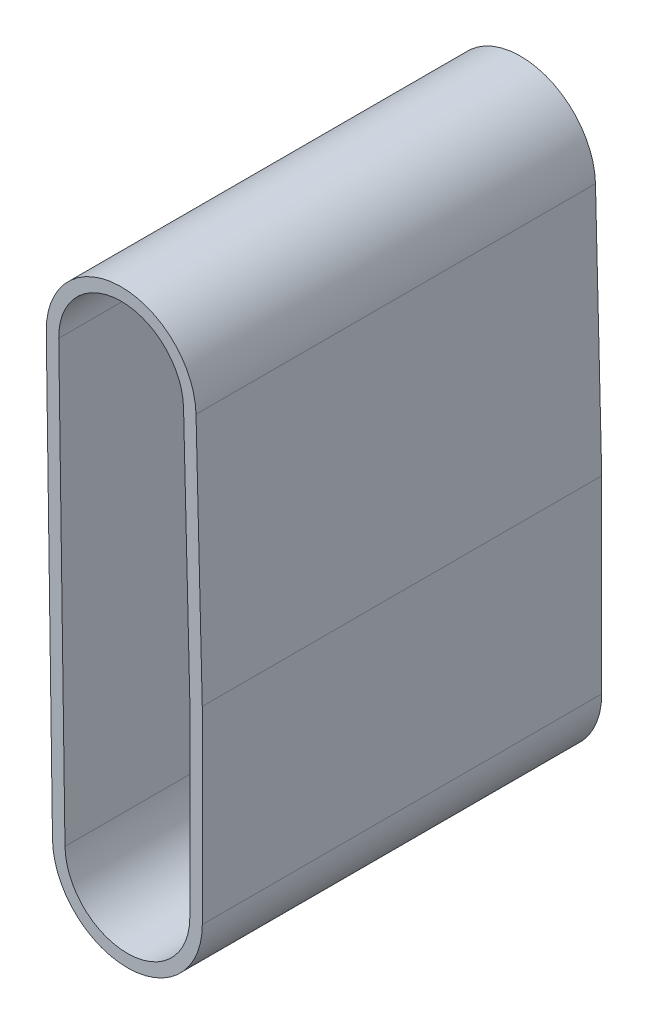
ISO-10303-21;
HEADER;
FILE_DESCRIPTION(('STEP AP214'),'2;1');
FILE_NAME('part.step','',(''),(''),'','','');
FILE_SCHEMA(('AUTOMOTIVE_DESIGN { 1 0 10303 214 1 1 1 1 }'));
ENDSEC;
DATA;
#1=APPLICATION_CONTEXT('core data for automotive mechanical design processes');
#2=APPLICATION_PROTOCOL_DEFINITION('international standard','automotive_design',2000,#1);
#3=PRODUCT_CONTEXT('',#1,'mechanical');
#4=PRODUCT('Part','Part','',(#3));
#5=PRODUCT_RELATED_PRODUCT_CATEGORY('part','',(#4));
#6=PRODUCT_DEFINITION_FORMATION('','',#4);
#7=PRODUCT_DEFINITION_CONTEXT('part definition',#1,'design');
#8=PRODUCT_DEFINITION('design','',#6,#7);
#9=PRODUCT_DEFINITION_SHAPE('','',#8);
#10=(LENGTH_UNIT() NAMED_UNIT(*) SI_UNIT(.MILLI.,.METRE.));
#11=(NAMED_UNIT(*) PLANE_ANGLE_UNIT() SI_UNIT($,.RADIAN.));
#12=(NAMED_UNIT(*) SI_UNIT($,.STERADIAN.) SOLID_ANGLE_UNIT());
#13=UNCERTAINTY_MEASURE_WITH_UNIT(LENGTH_MEASURE(1.E-05),#10,'distance_accuracy_value','');
#14=(GEOMETRIC_REPRESENTATION_CONTEXT(3) GLOBAL_UNCERTAINTY_ASSIGNED_CONTEXT((#13)) GLOBAL_UNIT_ASSIGNED_CONTEXT((#10,
#11,#12)) REPRESENTATION_CONTEXT('',''));
#15=CARTESIAN_POINT('',(0.,0.,0.));
#16=DIRECTION('',(0.,0.,1.));
#17=DIRECTION('',(1.,0.,0.));
#18=AXIS2_PLACEMENT_3D('',#15,#16,#17);
#19=CARTESIAN_POINT('',(-2.5,175.,-80.));
#20=DIRECTION('',(0.,0.,1.));
#21=DIRECTION('',(1.,0.,0.));
#22=AXIS2_PLACEMENT_3D('',#19,#20,#21);
#23=CYLINDRICAL_SURFACE('',#22,30.);
#24=DIRECTION('',(0.,0.,1.));
#25=VECTOR('',#24,1.);
#26=CARTESIAN_POINT('',(-32.4969392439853,174.571472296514,-80.));
#27=LINE('',#26,#25);
#28=CARTESIAN_POINT('',(-32.4969392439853,174.571472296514,-80.));
#29=VERTEX_POINT('',#28);
#30=CARTESIAN_POINT('',(-32.4969392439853,174.571472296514,80.));
#31=VERTEX_POINT('',#30);
#32=EDGE_CURVE('E46',#29,#31,#27,.T.);
#33=ORIENTED_EDGE('',*,*,#32,.T.);
#34=CARTESIAN_POINT('',(-2.5,175.,80.));
#35=DIRECTION('',(0.,0.,1.));
#36=DIRECTION('',(1.,0.,0.));
#37=AXIS2_PLACEMENT_3D('',#34,#35,#36);
#38=CIRCLE('',#37,30.);
#39=CARTESIAN_POINT('',(27.4906293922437,175.749765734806,80.));
#40=VERTEX_POINT('',#39);
#41=EDGE_CURVE('E161',#40,#31,#38,.T.);
#42=ORIENTED_EDGE('',*,*,#41,.F.);
#43=DIRECTION('',(0.,0.,1.));
#44=VECTOR('',#43,1.);
#45=CARTESIAN_POINT('',(27.4906293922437,175.749765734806,-80.));
#46=LINE('',#45,#44);
#47=CARTESIAN_POINT('',(27.4906293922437,175.749765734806,-80.));
#48=VERTEX_POINT('',#47);
#49=EDGE_CURVE('E11',#48,#40,#46,.T.);
#50=ORIENTED_EDGE('',*,*,#49,.F.);
#51=CARTESIAN_POINT('',(-2.5,175.,-80.));
#52=DIRECTION('',(0.,0.,1.));
#53=DIRECTION('',(1.,0.,0.));
#54=AXIS2_PLACEMENT_3D('',#51,#52,#53);
#55=CIRCLE('',#54,30.);
#56=EDGE_CURVE('E197',#48,#29,#55,.T.);
#57=ORIENTED_EDGE('',*,*,#56,.T.);
#58=EDGE_LOOP('',(#33,#42,#50,#57));
#59=FACE_BOUND('',#58,.T.);
#60=ADVANCED_FACE('F43',(#59),#23,.T.);
#61=CARTESIAN_POINT('',(27.4906293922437,175.749765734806,-80.));
#62=DIRECTION('',(0.999687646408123,0.024992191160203,0.));
#63=DIRECTION('',(-0.024992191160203,0.999687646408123,0.));
#64=AXIS2_PLACEMENT_3D('',#61,#62,#63);
#65=PLANE('',#64);
#66=ORIENTED_EDGE('',*,*,#49,.T.);
#67=DIRECTION('',(-0.024992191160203,0.999687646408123,0.));
#68=VECTOR('',#67,1.);
#69=CARTESIAN_POINT('',(27.4906293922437,175.749765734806,80.));
#70=LINE('',#69,#68);
#71=CARTESIAN_POINT('',(29.9921847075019,75.687553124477,80.));
#72=VERTEX_POINT('',#71);
#73=EDGE_CURVE('E177',#72,#40,#70,.T.);
#74=ORIENTED_EDGE('',*,*,#73,.F.);
#75=DIRECTION('',(0.,0.,1.));
#76=VECTOR('',#75,1.);
#77=CARTESIAN_POINT('',(29.9921847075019,75.687553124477,-80.));
#78=LINE('',#77,#76);
#79=CARTESIAN_POINT('',(29.9921847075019,75.687553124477,-80.));
#80=VERTEX_POINT('',#79);
#81=EDGE_CURVE('E52',#80,#72,#78,.T.);
#82=ORIENTED_EDGE('',*,*,#81,.F.);
#83=DIRECTION('',(-0.024992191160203,0.999687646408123,0.));
#84=VECTOR('',#83,1.);
#85=CARTESIAN_POINT('',(27.4906293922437,175.749765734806,-80.));
#86=LINE('',#85,#84);
#87=EDGE_CURVE('E220',#80,#48,#86,.T.);
#88=ORIENTED_EDGE('',*,*,#87,.T.);
#89=EDGE_LOOP('',(#66,#74,#82,#88));
#90=FACE_BOUND('',#89,.T.);
#91=ADVANCED_FACE('F240',(#90),#65,.T.);
#92=CARTESIAN_POINT('',(29.9921847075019,75.687553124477,-80.));
#93=DIRECTION('',(0.999999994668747,0.000103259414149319,0.));
#94=DIRECTION('',(-0.000103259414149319,0.999999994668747,0.));
#95=AXIS2_PLACEMENT_3D('',#92,#93,#94);
#96=PLANE('',#95);
#97=ORIENTED_EDGE('',*,*,#81,.T.);
#98=DIRECTION('',(-0.000103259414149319,0.999999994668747,0.));
#99=VECTOR('',#98,1.);
#100=CARTESIAN_POINT('',(29.9921847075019,75.687553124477,80.));
#101=LINE('',#100,#99);
#102=CARTESIAN_POINT('',(29.9999998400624,0.00309778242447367,80.));
#103=VERTEX_POINT('',#102);
#104=EDGE_CURVE('E173',#103,#72,#101,.T.);
#105=ORIENTED_EDGE('',*,*,#104,.F.);
#106=DIRECTION('',(0.,0.,1.));
#107=VECTOR('',#106,1.);
#108=CARTESIAN_POINT('',(29.9999998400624,0.00309778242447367,-80.));
#109=LINE('',#108,#107);
#110=CARTESIAN_POINT('',(29.9999998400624,0.00309778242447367,-80.));
#111=VERTEX_POINT('',#110);
#112=EDGE_CURVE('E226',#111,#103,#109,.T.);
#113=ORIENTED_EDGE('',*,*,#112,.F.);
#114=DIRECTION('',(-0.000103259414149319,0.999999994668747,0.));
#115=VECTOR('',#114,1.);
#116=CARTESIAN_POINT('',(29.9921847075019,75.687553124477,-80.));
#117=LINE('',#116,#115);
#118=EDGE_CURVE('E216',#111,#80,#117,.T.);
#119=ORIENTED_EDGE('',*,*,#118,.T.);
#120=EDGE_LOOP('',(#97,#105,#113,#119));
#121=FACE_BOUND('',#120,.T.);
#122=ADVANCED_FACE('F249',(#121),#96,.T.);
#123=CARTESIAN_POINT('',(0.,0.,-80.));
#124=DIRECTION('',(0.,0.,1.));
#125=DIRECTION('',(1.,0.,0.));
#126=AXIS2_PLACEMENT_3D('',#123,#124,#125);
#127=CYLINDRICAL_SURFACE('',#126,30.);
#128=ORIENTED_EDGE('',*,*,#112,.T.);
#129=CARTESIAN_POINT('',(0.,0.,80.));
#130=DIRECTION('',(0.,0.,1.));
#131=DIRECTION('',(1.,0.,0.));
#132=AXIS2_PLACEMENT_3D('',#129,#130,#131);
#133=CIRCLE('',#132,30.);
#134=CARTESIAN_POINT('',(-29.9969392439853,-0.428527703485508,80.));
#135=VERTEX_POINT('',#134);
#136=EDGE_CURVE('E169',#135,#103,#133,.T.);
#137=ORIENTED_EDGE('',*,*,#136,.F.);
#138=DIRECTION('',(0.,0.,1.));
#139=VECTOR('',#138,1.);
#140=CARTESIAN_POINT('',(-29.9969392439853,-0.428527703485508,-80.));
#141=LINE('',#140,#139);
#142=CARTESIAN_POINT('',(-29.9969392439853,-0.428527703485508,-80.));
#143=VERTEX_POINT('',#142);
#144=EDGE_CURVE('E228',#143,#135,#141,.T.);
#145=ORIENTED_EDGE('',*,*,#144,.F.);
#146=CARTESIAN_POINT('',(0.,0.,-80.));
#147=DIRECTION('',(0.,0.,1.));
#148=DIRECTION('',(1.,0.,0.));
#149=AXIS2_PLACEMENT_3D('',#146,#147,#148);
#150=CIRCLE('',#149,30.);
#151=EDGE_CURVE('E212',#143,#111,#150,.T.);
#152=ORIENTED_EDGE('',*,*,#151,.T.);
#153=EDGE_LOOP('',(#128,#137,#145,#152));
#154=FACE_BOUND('',#153,.T.);
#155=ADVANCED_FACE('F247',(#154),#127,.T.);
#156=CARTESIAN_POINT('',(-32.4969392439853,174.571472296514,-80.));
#157=DIRECTION('',(-0.99989797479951,-0.0142842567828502,0.));
#158=DIRECTION('',(0.0142842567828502,-0.99989797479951,0.));
#159=AXIS2_PLACEMENT_3D('',#156,#157,#158);
#160=PLANE('',#159);
#161=ORIENTED_EDGE('',*,*,#144,.T.);
#162=DIRECTION('',(0.0142842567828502,-0.99989797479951,0.));
#163=VECTOR('',#162,1.);
#164=CARTESIAN_POINT('',(-32.4969392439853,174.571472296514,80.));
#165=LINE('',#164,#163);
#166=EDGE_CURVE('E165',#31,#135,#165,.T.);
#167=ORIENTED_EDGE('',*,*,#166,.F.);
#168=ORIENTED_EDGE('',*,*,#32,.F.);
#169=DIRECTION('',(0.0142842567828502,-0.99989797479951,0.));
#170=VECTOR('',#169,1.);
#171=CARTESIAN_POINT('',(-32.4969392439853,174.571472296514,-80.));
#172=LINE('',#171,#170);
#173=EDGE_CURVE('E208',#29,#143,#172,.T.);
#174=ORIENTED_EDGE('',*,*,#173,.T.);
#175=EDGE_LOOP('',(#161,#167,#168,#174));
#176=FACE_BOUND('',#175,.T.);
#177=ADVANCED_FACE('F234',(#176),#160,.T.);
#178=CARTESIAN_POINT('',(-2.5,175.,-80.));
#179=DIRECTION('',(0.,0.,1.));
#180=DIRECTION('',(1.,0.,0.));
#181=AXIS2_PLACEMENT_3D('',#178,#179,#180);
#182=PLANE('',#181);
#183=DIRECTION('',(-0.024992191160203,0.999687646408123,0.));
#184=VECTOR('',#183,1.);
#185=CARTESIAN_POINT('',(22.4921911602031,175.624804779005,-80.));
#186=LINE('',#185,#184);
#187=CARTESIAN_POINT('',(24.9921911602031,75.6248047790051,-80.));
#188=VERTEX_POINT('',#187);
#189=CARTESIAN_POINT('',(22.4921911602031,175.624804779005,-80.));
#190=VERTEX_POINT('',#189);
#191=EDGE_CURVE('E134',#188,#190,#186,.T.);
#192=ORIENTED_EDGE('',*,*,#191,.T.);
#193=CARTESIAN_POINT('',(-2.5,175.,-80.));
#194=DIRECTION('',(0.,0.,1.));
#195=DIRECTION('',(1.,0.,0.));
#196=AXIS2_PLACEMENT_3D('',#193,#194,#195);
#197=CIRCLE('',#196,25.);
#198=CARTESIAN_POINT('',(-27.4974493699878,174.642893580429,-80.));
#199=VERTEX_POINT('',#198);
#200=EDGE_CURVE('E181',#190,#199,#197,.T.);
#201=ORIENTED_EDGE('',*,*,#200,.T.);
#202=DIRECTION('',(0.0142842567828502,-0.99989797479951,0.));
#203=VECTOR('',#202,1.);
#204=CARTESIAN_POINT('',(-27.4974493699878,174.642893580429,-80.));
#205=LINE('',#204,#203);
#206=CARTESIAN_POINT('',(-24.9974493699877,-0.357106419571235,-80.));
#207=VERTEX_POINT('',#206);
#208=EDGE_CURVE('E128',#199,#207,#205,.T.);
#209=ORIENTED_EDGE('',*,*,#208,.T.);
#210=CARTESIAN_POINT('',(0.,0.,-80.));
#211=DIRECTION('',(0.,0.,1.));
#212=DIRECTION('',(1.,0.,0.));
#213=AXIS2_PLACEMENT_3D('',#210,#211,#212);
#214=CIRCLE('',#213,25.);
#215=CARTESIAN_POINT('',(24.9999998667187,0.00258148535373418,-80.));
#216=VERTEX_POINT('',#215);
#217=EDGE_CURVE('E60',#207,#216,#214,.T.);
#218=ORIENTED_EDGE('',*,*,#217,.T.);
#219=DIRECTION('',(-0.000103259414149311,0.999999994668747,0.));
#220=VECTOR('',#219,1.);
#221=CARTESIAN_POINT('',(24.9921911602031,75.6248047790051,-80.));
#222=LINE('',#221,#220);
#223=EDGE_CURVE('E188',#216,#188,#222,.T.);
#224=ORIENTED_EDGE('',*,*,#223,.T.);
#225=EDGE_LOOP('',(#192,#201,#209,#218,#224));
#226=FACE_BOUND('',#225,.T.);
#227=ORIENTED_EDGE('',*,*,#56,.F.);
#228=ORIENTED_EDGE('',*,*,#87,.F.);
#229=ORIENTED_EDGE('',*,*,#118,.F.);
#230=ORIENTED_EDGE('',*,*,#151,.F.);
#231=ORIENTED_EDGE('',*,*,#173,.F.);
#232=EDGE_LOOP('',(#227,#228,#229,#230,#231));
#233=FACE_BOUND('',#232,.T.);
#234=ADVANCED_FACE('F244',(#226,#233),#182,.F.);
#235=CARTESIAN_POINT('',(-2.5,175.,-80.));
#236=DIRECTION('',(0.,0.,1.));
#237=DIRECTION('',(1.,0.,0.));
#238=AXIS2_PLACEMENT_3D('',#235,#236,#237);
#239=CYLINDRICAL_SURFACE('',#238,25.);
#240=DIRECTION('',(0.,0.,1.));
#241=VECTOR('',#240,1.);
#242=CARTESIAN_POINT('',(22.4921911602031,175.624804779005,-80.));
#243=LINE('',#242,#241);
#244=CARTESIAN_POINT('',(22.4921911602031,175.624804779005,80.));
#245=VERTEX_POINT('',#244);
#246=EDGE_CURVE('E139',#190,#245,#243,.T.);
#247=ORIENTED_EDGE('',*,*,#246,.T.);
#248=CARTESIAN_POINT('',(-2.5,175.,80.));
#249=DIRECTION('',(0.,0.,1.));
#250=DIRECTION('',(1.,0.,0.));
#251=AXIS2_PLACEMENT_3D('',#248,#249,#250);
#252=CIRCLE('',#251,25.);
#253=CARTESIAN_POINT('',(-27.4974493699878,174.642893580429,80.));
#254=VERTEX_POINT('',#253);
#255=EDGE_CURVE('E137',#245,#254,#252,.T.);
#256=ORIENTED_EDGE('',*,*,#255,.T.);
#257=DIRECTION('',(0.,0.,1.));
#258=VECTOR('',#257,1.);
#259=CARTESIAN_POINT('',(-27.4974493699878,174.642893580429,-80.));
#260=LINE('',#259,#258);
#261=EDGE_CURVE('E121',#199,#254,#260,.T.);
#262=ORIENTED_EDGE('',*,*,#261,.F.);
#263=ORIENTED_EDGE('',*,*,#200,.F.);
#264=EDGE_LOOP('',(#247,#256,#262,#263));
#265=FACE_BOUND('',#264,.T.);
#266=ADVANCED_FACE('F138',(#265),#239,.F.);
#267=CARTESIAN_POINT('',(22.4921911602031,175.624804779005,-80.));
#268=DIRECTION('',(0.999687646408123,0.024992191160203,0.));
#269=DIRECTION('',(-0.024992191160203,0.999687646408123,0.));
#270=AXIS2_PLACEMENT_3D('',#267,#268,#269);
#271=PLANE('',#270);
#272=DIRECTION('',(0.,0.,1.));
#273=VECTOR('',#272,1.);
#274=CARTESIAN_POINT('',(24.9921911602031,75.6248047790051,-80.));
#275=LINE('',#274,#273);
#276=CARTESIAN_POINT('',(24.9921911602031,75.6248047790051,80.));
#277=VERTEX_POINT('',#276);
#278=EDGE_CURVE('E198',#188,#277,#275,.T.);
#279=ORIENTED_EDGE('',*,*,#278,.T.);
#280=DIRECTION('',(-0.024992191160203,0.999687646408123,0.));
#281=VECTOR('',#280,1.);
#282=CARTESIAN_POINT('',(22.4921911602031,175.624804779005,80.));
#283=LINE('',#282,#281);
#284=EDGE_CURVE('E158',#277,#245,#283,.T.);
#285=ORIENTED_EDGE('',*,*,#284,.T.);
#286=ORIENTED_EDGE('',*,*,#246,.F.);
#287=ORIENTED_EDGE('',*,*,#191,.F.);
#288=EDGE_LOOP('',(#279,#285,#286,#287));
#289=FACE_BOUND('',#288,.T.);
#290=ADVANCED_FACE('F305',(#289),#271,.F.);
#291=CARTESIAN_POINT('',(24.9921911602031,75.6248047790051,-80.));
#292=DIRECTION('',(0.999999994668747,0.000103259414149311,0.));
#293=DIRECTION('',(-0.000103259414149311,0.999999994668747,0.));
#294=AXIS2_PLACEMENT_3D('',#291,#292,#293);
#295=PLANE('',#294);
#296=DIRECTION('',(0.,0.,1.));
#297=VECTOR('',#296,1.);
#298=CARTESIAN_POINT('',(24.9999998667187,0.00258148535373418,-80.));
#299=LINE('',#298,#297);
#300=CARTESIAN_POINT('',(24.9999998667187,0.00258148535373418,80.));
#301=VERTEX_POINT('',#300);
#302=EDGE_CURVE('E201',#216,#301,#299,.T.);
#303=ORIENTED_EDGE('',*,*,#302,.T.);
#304=DIRECTION('',(-0.000103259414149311,0.999999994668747,0.));
#305=VECTOR('',#304,1.);
#306=CARTESIAN_POINT('',(24.9921911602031,75.6248047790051,80.));
#307=LINE('',#306,#305);
#308=EDGE_CURVE('E152',#301,#277,#307,.T.);
#309=ORIENTED_EDGE('',*,*,#308,.T.);
#310=ORIENTED_EDGE('',*,*,#278,.F.);
#311=ORIENTED_EDGE('',*,*,#223,.F.);
#312=EDGE_LOOP('',(#303,#309,#310,#311));
#313=FACE_BOUND('',#312,.T.);
#314=ADVANCED_FACE('F315',(#313),#295,.F.);
#315=CARTESIAN_POINT('',(0.,0.,-80.));
#316=DIRECTION('',(0.,0.,1.));
#317=DIRECTION('',(1.,0.,0.));
#318=AXIS2_PLACEMENT_3D('',#315,#316,#317);
#319=CYLINDRICAL_SURFACE('',#318,25.);
#320=DIRECTION('',(0.,0.,1.));
#321=VECTOR('',#320,1.);
#322=CARTESIAN_POINT('',(-24.9974493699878,-0.357106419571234,-80.));
#323=LINE('',#322,#321);
#324=CARTESIAN_POINT('',(-24.9974493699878,-0.357106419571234,80.));
#325=VERTEX_POINT('',#324);
#326=EDGE_CURVE('E133',#207,#325,#323,.T.);
#327=ORIENTED_EDGE('',*,*,#326,.T.);
#328=CARTESIAN_POINT('',(0.,0.,80.));
#329=DIRECTION('',(0.,0.,1.));
#330=DIRECTION('',(1.,0.,0.));
#331=AXIS2_PLACEMENT_3D('',#328,#329,#330);
#332=CIRCLE('',#331,25.);
#333=EDGE_CURVE('E148',#325,#301,#332,.T.);
#334=ORIENTED_EDGE('',*,*,#333,.T.);
#335=ORIENTED_EDGE('',*,*,#302,.F.);
#336=ORIENTED_EDGE('',*,*,#217,.F.);
#337=EDGE_LOOP('',(#327,#334,#335,#336));
#338=FACE_BOUND('',#337,.T.);
#339=ADVANCED_FACE('F326',(#338),#319,.F.);
#340=CARTESIAN_POINT('',(-27.4974493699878,174.642893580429,-80.));
#341=DIRECTION('',(-0.99989797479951,-0.0142842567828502,0.));
#342=DIRECTION('',(0.0142842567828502,-0.99989797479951,0.));
#343=AXIS2_PLACEMENT_3D('',#340,#341,#342);
#344=PLANE('',#343);
#345=ORIENTED_EDGE('',*,*,#261,.T.);
#346=DIRECTION('',(0.0142842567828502,-0.99989797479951,0.));
#347=VECTOR('',#346,1.);
#348=CARTESIAN_POINT('',(-27.4974493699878,174.642893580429,80.));
#349=LINE('',#348,#347);
#350=EDGE_CURVE('E125',#254,#325,#349,.T.);
#351=ORIENTED_EDGE('',*,*,#350,.T.);
#352=ORIENTED_EDGE('',*,*,#326,.F.);
#353=ORIENTED_EDGE('',*,*,#208,.F.);
#354=EDGE_LOOP('',(#345,#351,#352,#353));
#355=FACE_BOUND('',#354,.T.);
#356=ADVANCED_FACE('F123',(#355),#344,.F.);
#357=CARTESIAN_POINT('',(-2.5,175.,80.));
#358=DIRECTION('',(0.,0.,1.));
#359=DIRECTION('',(1.,0.,0.));
#360=AXIS2_PLACEMENT_3D('',#357,#358,#359);
#361=PLANE('',#360);
#362=ORIENTED_EDGE('',*,*,#41,.T.);
#363=ORIENTED_EDGE('',*,*,#166,.T.);
#364=ORIENTED_EDGE('',*,*,#136,.T.);
#365=ORIENTED_EDGE('',*,*,#104,.T.);
#366=ORIENTED_EDGE('',*,*,#73,.T.);
#367=EDGE_LOOP('',(#362,#363,#364,#365,#366));
#368=FACE_BOUND('',#367,.T.);
#369=ORIENTED_EDGE('',*,*,#350,.F.);
#370=ORIENTED_EDGE('',*,*,#255,.F.);
#371=ORIENTED_EDGE('',*,*,#284,.F.);
#372=ORIENTED_EDGE('',*,*,#308,.F.);
#373=ORIENTED_EDGE('',*,*,#333,.F.);
#374=EDGE_LOOP('',(#369,#370,#371,#372,#373));
#375=FACE_BOUND('',#374,.T.);
#376=ADVANCED_FACE('F145',(#368,#375),#361,.T.);
#377=CLOSED_SHELL('',(#60,#91,#122,#155,#177,#234,#266,#290,#314,#339,#356,#376));
#378=MANIFOLD_SOLID_BREP('B2',#377);
#379=ADVANCED_BREP_SHAPE_REPRESENTATION('',(#18,#378),#14);
#380=SHAPE_DEFINITION_REPRESENTATION(#9,#379);
ENDSEC;
END-ISO-10303-21;
